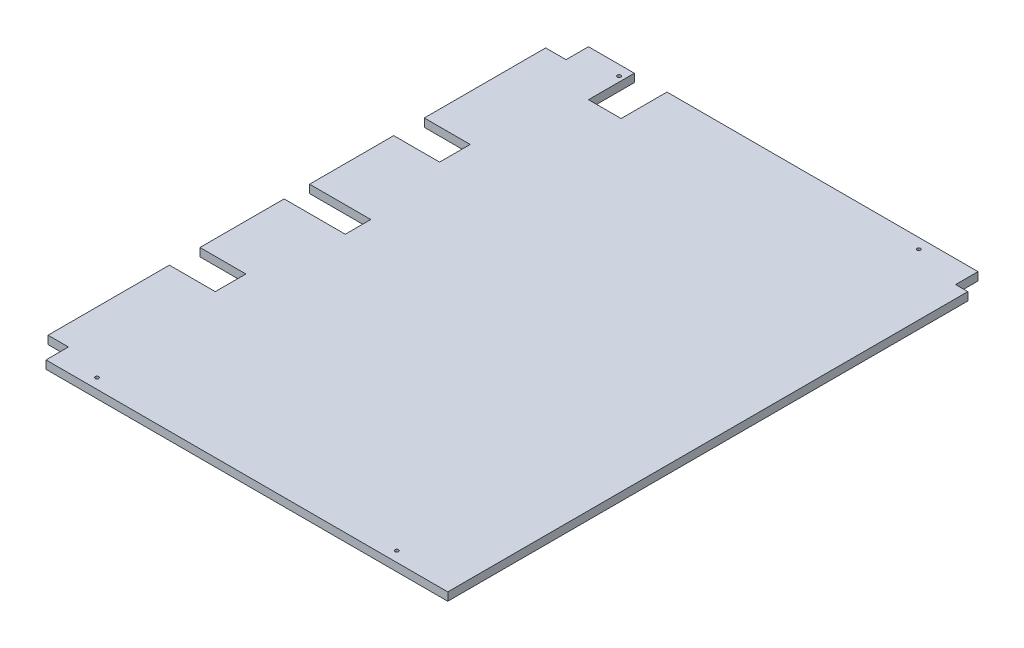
from build123d import *

# Parameters (mm, degrees)
SKIZZE1_W                        = 414
SKIZZE1_H                        = 532
AUFSATZ_LINEAR_AUSTRAGEN1_DEPTH  = 8
SKIZZE2_W                        = 20
SKIZZE2_H                        = 22
SKIZZE2_W_2                      = 12
SCHNITT_LINEAR_AUSTRAGEN1_DEPTH  = 338.148335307
SKIZZE3_W                        = 45
SKIZZE3_H                        = 30
SKIZZE3_W_2                      = 60
SKIZZE3_H_2                      = 25
SKIZZE3_W_3                      = 32
SKIZZE3_H_3                      = 45
SCHNITT_LINEAR_AUSTRAGEN2_DEPTH  = 338.148335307
F_3_5_3_5_DURCHMESSER_BOHRUNG1_D = 3.5
FASE1_SIZE                       = 1.5


with BuildPart() as part:
    # Skizze1 → Aufsatz-Linear austragen1 (new body)
    with BuildSketch(Plane(origin=(0, 0, 0), x_dir=(1, 0, 0), z_dir=(0, 1, 0))):
        Rectangle(SKIZZE1_W, SKIZZE1_H)
    extrude(amount=AUFSATZ_LINEAR_AUSTRAGEN1_DEPTH)

    # Skizze2 → Schnitt-Linear austragen1 (cut, through all)
    with BuildSketch(Plane(origin=(0, 8, 0), x_dir=(1, 0, 0), z_dir=(0, 1, 0))):
        with Locations((-197, -255)):
            Rectangle(SKIZZE2_W, SKIZZE2_H)
        with Locations((-197, 255)):
            Rectangle(SKIZZE2_W, SKIZZE2_H)
        with Locations((201, 255)):
            Rectangle(SKIZZE2_W_2, SKIZZE2_H)
    extrude(amount=-SCHNITT_LINEAR_AUSTRAGEN1_DEPTH, mode=Mode.SUBTRACT)

    # Skizze3 → Schnitt-Linear austragen2 (cut, through all)
    with BuildSketch(Plane(origin=(0, 8, 0), x_dir=(1, 0, 0), z_dir=(0, 1, 0))):
        with Locations((-184.5, 110)):
            Rectangle(SKIZZE3_W, SKIZZE3_H)
        with Locations((-184.5, -110)):
            Rectangle(SKIZZE3_W, SKIZZE3_H)
        with Locations((-177, 0)):
            Rectangle(SKIZZE3_W_2, SKIZZE3_H_2)
        with Locations((-126, 243.5)):
            Rectangle(SKIZZE3_W_3, SKIZZE3_H_3)
    extrude(amount=-SCHNITT_LINEAR_AUSTRAGEN2_DEPTH, mode=Mode.SUBTRACT)

    # 3.5 _3.5_ Durchmesser Bohrung1 (through all)
    with Locations(Plane(origin=(0, 8, 0), x_dir=(1, 0, 0), z_dir=(0, 1, 0))):
        with Locations((-147, -256), (147, -256), (147, 256), (-147, 256)):
            Hole(F_3_5_3_5_DURCHMESSER_BOHRUNG1_D / 2)

    # Fase1
    fase1_edges = [part.edges().sort_by_distance(p)[0] for p in [
        (-145.25, 0, -256),
        (148.75, 0, -256),
        (148.75, 0, 256),
        (-145.25, 0, 256),
    ]]
    chamfer(fase1_edges, length=FASE1_SIZE)


solid = part.part
